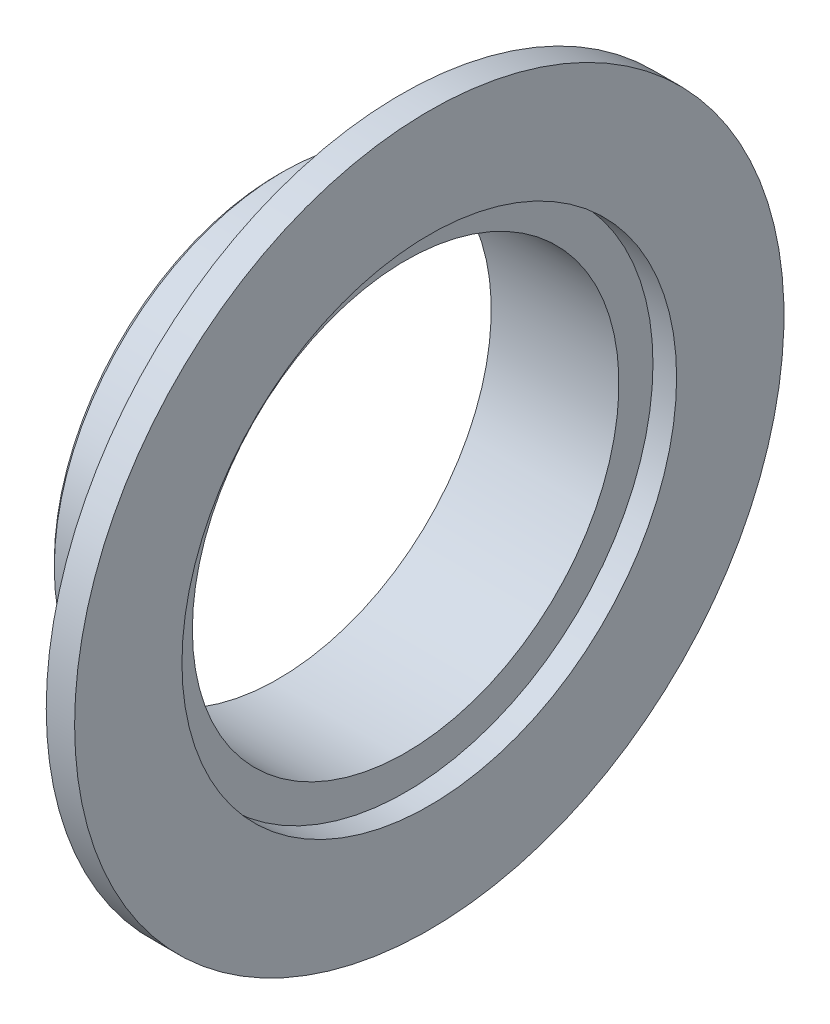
ISO-10303-21;
HEADER;
FILE_DESCRIPTION(('STEP AP214'),'2;1');
FILE_NAME('part.step','',(''),(''),'','','');
FILE_SCHEMA(('AUTOMOTIVE_DESIGN { 1 0 10303 214 1 1 1 1 }'));
ENDSEC;
DATA;
#1=APPLICATION_CONTEXT('core data for automotive mechanical design processes');
#2=APPLICATION_PROTOCOL_DEFINITION('international standard','automotive_design',2000,#1);
#3=PRODUCT_CONTEXT('',#1,'mechanical');
#4=PRODUCT('Part','Part','',(#3));
#5=PRODUCT_RELATED_PRODUCT_CATEGORY('part','',(#4));
#6=PRODUCT_DEFINITION_FORMATION('','',#4);
#7=PRODUCT_DEFINITION_CONTEXT('part definition',#1,'design');
#8=PRODUCT_DEFINITION('design','',#6,#7);
#9=PRODUCT_DEFINITION_SHAPE('','',#8);
#10=(LENGTH_UNIT() NAMED_UNIT(*) SI_UNIT(.MILLI.,.METRE.));
#11=(NAMED_UNIT(*) PLANE_ANGLE_UNIT() SI_UNIT($,.RADIAN.));
#12=(NAMED_UNIT(*) SI_UNIT($,.STERADIAN.) SOLID_ANGLE_UNIT());
#13=UNCERTAINTY_MEASURE_WITH_UNIT(LENGTH_MEASURE(1.E-05),#10,'distance_accuracy_value','');
#14=(GEOMETRIC_REPRESENTATION_CONTEXT(3) GLOBAL_UNCERTAINTY_ASSIGNED_CONTEXT((#13)) GLOBAL_UNIT_ASSIGNED_CONTEXT((#10,
#11,#12)) REPRESENTATION_CONTEXT('',''));
#15=CARTESIAN_POINT('',(0.,0.,0.));
#16=DIRECTION('',(0.,0.,1.));
#17=DIRECTION('',(1.,0.,0.));
#18=AXIS2_PLACEMENT_3D('',#15,#16,#17);
#19=CARTESIAN_POINT('',(0.500000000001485,0.,0.));
#20=DIRECTION('',(1.,0.,0.));
#21=DIRECTION('',(0.,0.,-1.));
#22=AXIS2_PLACEMENT_3D('',#19,#20,#21);
#23=CONICAL_SURFACE('',#22,24.1499999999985,0.7853981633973);
#24=CARTESIAN_POINT('',(1.41553435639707E-12,0.,0.));
#25=DIRECTION('',(1.,0.,0.));
#26=DIRECTION('',(0.,0.,-1.));
#27=AXIS2_PLACEMENT_3D('',#24,#25,#26);
#28=CIRCLE('',#27,23.6499999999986);
#29=CARTESIAN_POINT('',(1.41553435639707E-12,0.,-23.6499999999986));
#30=VERTEX_POINT('',#29);
#31=EDGE_CURVE('E18',#30,#30,#28,.F.);
#32=ORIENTED_EDGE('',*,*,#31,.F.);
#33=EDGE_LOOP('',(#32));
#34=FACE_BOUND('',#33,.T.);
#35=CARTESIAN_POINT('',(0.5,0.,0.));
#36=DIRECTION('',(-1.,0.,0.));
#37=DIRECTION('',(0.,0.,1.));
#38=AXIS2_PLACEMENT_3D('',#35,#36,#37);
#39=CIRCLE('',#38,24.15);
#40=CARTESIAN_POINT('',(0.5,0.,24.15));
#41=VERTEX_POINT('',#40);
#42=EDGE_CURVE('E30',#41,#41,#39,.F.);
#43=ORIENTED_EDGE('',*,*,#42,.F.);
#44=EDGE_LOOP('',(#43));
#45=FACE_BOUND('',#44,.T.);
#46=ADVANCED_FACE('F15',(#34,#45),#23,.T.);
#47=CARTESIAN_POINT('',(0.,0.,0.));
#48=DIRECTION('',(-1.,0.,0.));
#49=DIRECTION('',(0.,0.,1.));
#50=AXIS2_PLACEMENT_3D('',#47,#48,#49);
#51=PLANE('',#50);
#52=CARTESIAN_POINT('',(0.,0.,0.));
#53=DIRECTION('',(-1.,0.,0.));
#54=DIRECTION('',(0.,0.,1.));
#55=AXIS2_PLACEMENT_3D('',#52,#53,#54);
#56=CIRCLE('',#55,22.55);
#57=CARTESIAN_POINT('',(0.,0.,22.55));
#58=VERTEX_POINT('',#57);
#59=EDGE_CURVE('E39',#58,#58,#56,.F.);
#60=ORIENTED_EDGE('',*,*,#59,.T.);
#61=EDGE_LOOP('',(#60));
#62=FACE_BOUND('',#61,.T.);
#63=ORIENTED_EDGE('',*,*,#31,.T.);
#64=EDGE_LOOP('',(#63));
#65=FACE_BOUND('',#64,.T.);
#66=ADVANCED_FACE('F50',(#62,#65),#51,.T.);
#67=CARTESIAN_POINT('',(16.8,0.,0.));
#68=DIRECTION('',(-1.,0.,0.));
#69=DIRECTION('',(0.,0.,1.));
#70=AXIS2_PLACEMENT_3D('',#67,#68,#69);
#71=CYLINDRICAL_SURFACE('',#70,24.15);
#72=CARTESIAN_POINT('',(9.4228782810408,0.,0.));
#73=DIRECTION('',(1.,0.,0.));
#74=DIRECTION('',(0.,0.,1.));
#75=AXIS2_PLACEMENT_3D('',#72,#73,#74);
#76=CIRCLE('',#75,24.1500000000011);
#77=CARTESIAN_POINT('',(9.4228782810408,0.,24.1500000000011));
#78=VERTEX_POINT('',#77);
#79=EDGE_CURVE('E38',#78,#78,#76,.T.);
#80=ORIENTED_EDGE('',*,*,#79,.F.);
#81=EDGE_LOOP('',(#80));
#82=FACE_BOUND('',#81,.T.);
#83=ORIENTED_EDGE('',*,*,#42,.T.);
#84=EDGE_LOOP('',(#83));
#85=FACE_BOUND('',#84,.T.);
#86=ADVANCED_FACE('F58',(#82,#85),#71,.T.);
#87=CARTESIAN_POINT('',(16.8,0.,0.));
#88=DIRECTION('',(-1.,0.,0.));
#89=DIRECTION('',(0.,0.,1.));
#90=AXIS2_PLACEMENT_3D('',#87,#88,#89);
#91=CYLINDRICAL_SURFACE('',#90,22.55);
#92=ORIENTED_EDGE('',*,*,#59,.F.);
#93=EDGE_LOOP('',(#92));
#94=FACE_BOUND('',#93,.T.);
#95=CARTESIAN_POINT('',(13.5,0.,0.));
#96=DIRECTION('',(-1.,0.,0.));
#97=DIRECTION('',(0.,0.,1.));
#98=AXIS2_PLACEMENT_3D('',#95,#96,#97);
#99=CIRCLE('',#98,22.55);
#100=CARTESIAN_POINT('',(13.5,0.,22.55));
#101=VERTEX_POINT('',#100);
#102=EDGE_CURVE('E36',#101,#101,#99,.F.);
#103=ORIENTED_EDGE('',*,*,#102,.T.);
#104=EDGE_LOOP('',(#103));
#105=FACE_BOUND('',#104,.T.);
#106=ADVANCED_FACE('F82',(#94,#105),#91,.F.);
#107=CARTESIAN_POINT('',(12.9999999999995,0.,0.));
#108=DIRECTION('',(1.,0.,0.));
#109=DIRECTION('',(0.,1.,0.));
#110=AXIS2_PLACEMENT_3D('',#107,#108,#109);
#111=CONICAL_SURFACE('',#110,37.5000000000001,1.3089969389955);
#112=ORIENTED_EDGE('',*,*,#79,.T.);
#113=EDGE_LOOP('',(#112));
#114=FACE_BOUND('',#113,.T.);
#115=CARTESIAN_POINT('',(13.,0.,0.));
#116=DIRECTION('',(-1.,0.,0.));
#117=DIRECTION('',(0.,0.,1.));
#118=AXIS2_PLACEMENT_3D('',#115,#116,#117);
#119=CIRCLE('',#118,37.5);
#120=CARTESIAN_POINT('',(13.,0.,37.5));
#121=VERTEX_POINT('',#120);
#122=EDGE_CURVE('E35',#121,#121,#119,.F.);
#123=ORIENTED_EDGE('',*,*,#122,.F.);
#124=EDGE_LOOP('',(#123));
#125=FACE_BOUND('',#124,.T.);
#126=ADVANCED_FACE('F78',(#114,#125),#111,.T.);
#127=CARTESIAN_POINT('',(13.5,0.,0.));
#128=DIRECTION('',(-1.,0.,0.));
#129=DIRECTION('',(0.,0.,1.));
#130=AXIS2_PLACEMENT_3D('',#127,#128,#129);
#131=PLANE('',#130);
#132=ORIENTED_EDGE('',*,*,#102,.F.);
#133=EDGE_LOOP('',(#132));
#134=FACE_BOUND('',#133,.T.);
#135=CARTESIAN_POINT('',(13.5,0.,0.));
#136=DIRECTION('',(-1.,0.,0.));
#137=DIRECTION('',(0.,0.,1.));
#138=AXIS2_PLACEMENT_3D('',#135,#136,#137);
#139=CIRCLE('',#138,26.15);
#140=CARTESIAN_POINT('',(13.5,0.,26.15));
#141=VERTEX_POINT('',#140);
#142=EDGE_CURVE('E27',#141,#141,#139,.F.);
#143=ORIENTED_EDGE('',*,*,#142,.T.);
#144=EDGE_LOOP('',(#143));
#145=FACE_BOUND('',#144,.T.);
#146=ADVANCED_FACE('F74',(#134,#145),#131,.F.);
#147=CARTESIAN_POINT('',(16.8,0.,0.));
#148=DIRECTION('',(-1.,0.,0.));
#149=DIRECTION('',(0.,0.,1.));
#150=AXIS2_PLACEMENT_3D('',#147,#148,#149);
#151=CYLINDRICAL_SURFACE('',#150,37.5);
#152=ORIENTED_EDGE('',*,*,#122,.T.);
#153=EDGE_LOOP('',(#152));
#154=FACE_BOUND('',#153,.T.);
#155=CARTESIAN_POINT('',(16.,0.,0.));
#156=DIRECTION('',(-1.,0.,0.));
#157=DIRECTION('',(0.,0.,1.));
#158=AXIS2_PLACEMENT_3D('',#155,#156,#157);
#159=CIRCLE('',#158,37.5);
#160=CARTESIAN_POINT('',(16.,0.,37.5));
#161=VERTEX_POINT('',#160);
#162=EDGE_CURVE('E22',#161,#161,#159,.T.);
#163=ORIENTED_EDGE('',*,*,#162,.T.);
#164=EDGE_LOOP('',(#163));
#165=FACE_BOUND('',#164,.T.);
#166=ADVANCED_FACE('F67',(#154,#165),#151,.T.);
#167=CARTESIAN_POINT('',(16.8,0.,0.));
#168=DIRECTION('',(-1.,0.,0.));
#169=DIRECTION('',(0.,0.,1.));
#170=AXIS2_PLACEMENT_3D('',#167,#168,#169);
#171=CYLINDRICAL_SURFACE('',#170,26.15);
#172=ORIENTED_EDGE('',*,*,#142,.F.);
#173=EDGE_LOOP('',(#172));
#174=FACE_BOUND('',#173,.T.);
#175=CARTESIAN_POINT('',(16.,0.,0.));
#176=DIRECTION('',(-1.,0.,0.));
#177=DIRECTION('',(0.,0.,1.));
#178=AXIS2_PLACEMENT_3D('',#175,#176,#177);
#179=CIRCLE('',#178,26.15);
#180=CARTESIAN_POINT('',(16.,0.,26.15));
#181=VERTEX_POINT('',#180);
#182=EDGE_CURVE('E9',#181,#181,#179,.F.);
#183=ORIENTED_EDGE('',*,*,#182,.T.);
#184=EDGE_LOOP('',(#183));
#185=FACE_BOUND('',#184,.T.);
#186=ADVANCED_FACE('F61',(#174,#185),#171,.F.);
#187=CARTESIAN_POINT('',(16.,0.,0.));
#188=DIRECTION('',(-1.,0.,0.));
#189=DIRECTION('',(0.,0.,1.));
#190=AXIS2_PLACEMENT_3D('',#187,#188,#189);
#191=PLANE('',#190);
#192=ORIENTED_EDGE('',*,*,#182,.F.);
#193=EDGE_LOOP('',(#192));
#194=FACE_BOUND('',#193,.T.);
#195=ORIENTED_EDGE('',*,*,#162,.F.);
#196=EDGE_LOOP('',(#195));
#197=FACE_BOUND('',#196,.T.);
#198=ADVANCED_FACE('F59',(#194,#197),#191,.F.);
#199=CLOSED_SHELL('',(#46,#66,#86,#106,#126,#146,#166,#186,#198));
#200=MANIFOLD_SOLID_BREP('B1',#199);
#201=ADVANCED_BREP_SHAPE_REPRESENTATION('',(#18,#200),#14);
#202=SHAPE_DEFINITION_REPRESENTATION(#9,#201);
ENDSEC;
END-ISO-10303-21;
